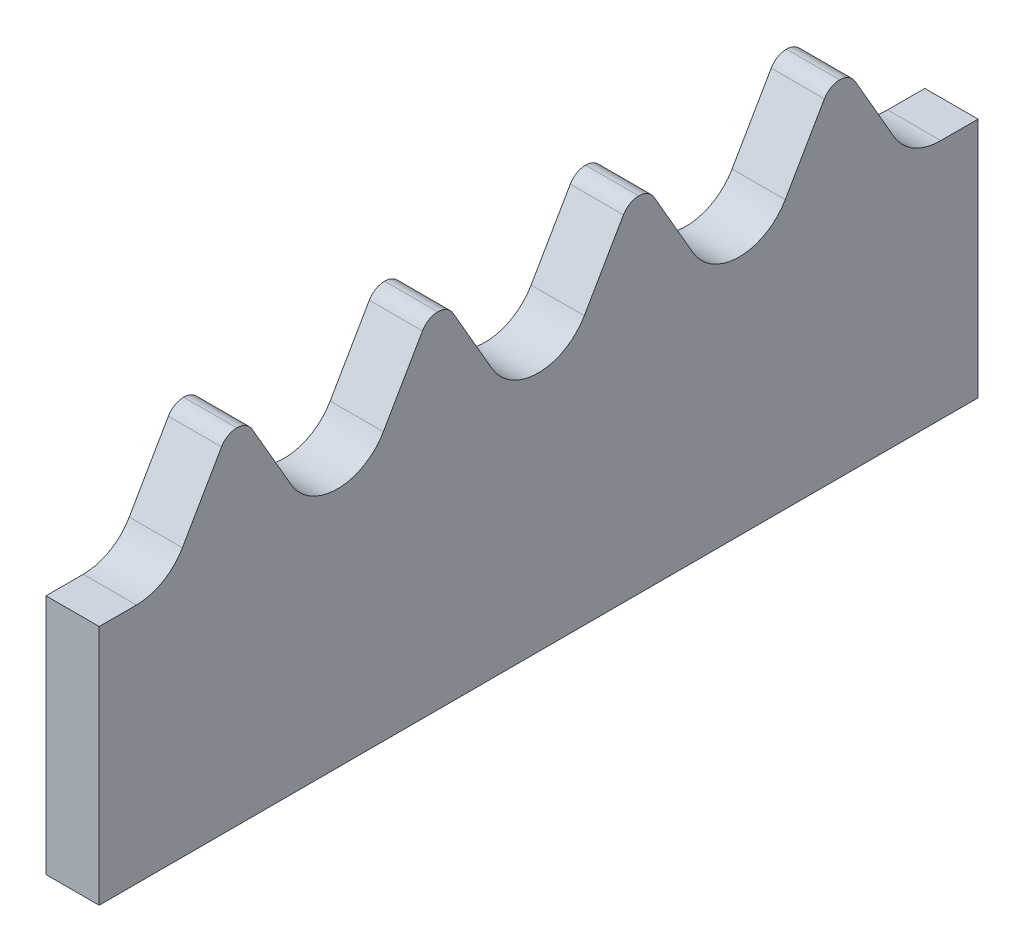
ISO-10303-21;
HEADER;
FILE_DESCRIPTION(('STEP AP214'),'2;1');
FILE_NAME('part.step','',(''),(''),'','','');
FILE_SCHEMA(('AUTOMOTIVE_DESIGN { 1 0 10303 214 1 1 1 1 }'));
ENDSEC;
DATA;
#1=APPLICATION_CONTEXT('core data for automotive mechanical design processes');
#2=APPLICATION_PROTOCOL_DEFINITION('international standard','automotive_design',2000,#1);
#3=PRODUCT_CONTEXT('',#1,'mechanical');
#4=PRODUCT('Part','Part','',(#3));
#5=PRODUCT_RELATED_PRODUCT_CATEGORY('part','',(#4));
#6=PRODUCT_DEFINITION_FORMATION('','',#4);
#7=PRODUCT_DEFINITION_CONTEXT('part definition',#1,'design');
#8=PRODUCT_DEFINITION('design','',#6,#7);
#9=PRODUCT_DEFINITION_SHAPE('','',#8);
#10=(LENGTH_UNIT() NAMED_UNIT(*) SI_UNIT(.MILLI.,.METRE.));
#11=(NAMED_UNIT(*) PLANE_ANGLE_UNIT() SI_UNIT($,.RADIAN.));
#12=(NAMED_UNIT(*) SI_UNIT($,.STERADIAN.) SOLID_ANGLE_UNIT());
#13=UNCERTAINTY_MEASURE_WITH_UNIT(LENGTH_MEASURE(1.E-05),#10,'distance_accuracy_value','');
#14=(GEOMETRIC_REPRESENTATION_CONTEXT(3) GLOBAL_UNCERTAINTY_ASSIGNED_CONTEXT((#13)) GLOBAL_UNIT_ASSIGNED_CONTEXT((#10,
#11,#12)) REPRESENTATION_CONTEXT('',''));
#15=CARTESIAN_POINT('',(0.,0.,0.));
#16=DIRECTION('',(0.,0.,1.));
#17=DIRECTION('',(1.,0.,0.));
#18=AXIS2_PLACEMENT_3D('',#15,#16,#17);
#19=CARTESIAN_POINT('',(-25.9999999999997,30.,44.9999999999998));
#20=DIRECTION('',(-1.,0.,0.));
#21=DIRECTION('',(0.,0.,1.));
#22=AXIS2_PLACEMENT_3D('',#19,#20,#21);
#23=PLANE('',#22);
#24=DIRECTION('',(0.,0.,-1.));
#25=VECTOR('',#24,1.);
#26=CARTESIAN_POINT('',(-25.9999999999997,7.99999999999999,44.9999999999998));
#27=LINE('',#26,#25);
#28=CARTESIAN_POINT('',(-25.9999999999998,8.00000000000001,20.4956734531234));
#29=VERTEX_POINT('',#28);
#30=CARTESIAN_POINT('',(-25.9999999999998,8.00000000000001,-29.1000000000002));
#31=VERTEX_POINT('',#30);
#32=EDGE_CURVE('E277',#29,#31,#27,.T.);
#33=ORIENTED_EDGE('',*,*,#32,.F.);
#34=DIRECTION('',(0.,-1.,0.));
#35=VECTOR('',#34,1.);
#36=CARTESIAN_POINT('',(-25.9999999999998,21.6256246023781,20.4956734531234));
#37=LINE('',#36,#35);
#38=CARTESIAN_POINT('',(-25.9999999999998,21.6256246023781,20.4956734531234));
#39=VERTEX_POINT('',#38);
#40=EDGE_CURVE('E282',#39,#29,#37,.T.);
#41=ORIENTED_EDGE('',*,*,#40,.F.);
#42=DIRECTION('',(0.,0.,1.));
#43=VECTOR('',#42,1.);
#44=CARTESIAN_POINT('',(-25.9999999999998,21.6256246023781,18.3956734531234));
#45=LINE('',#44,#43);
#46=CARTESIAN_POINT('',(-25.9999999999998,21.6256246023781,18.3956734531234));
#47=VERTEX_POINT('',#46);
#48=EDGE_CURVE('E274',#47,#39,#45,.T.);
#49=ORIENTED_EDGE('',*,*,#48,.F.);
#50=CARTESIAN_POINT('',(-25.9999999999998,24.6256246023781,18.3956734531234));
#51=DIRECTION('',(1.,0.,0.));
#52=DIRECTION('',(0.,0.,1.));
#53=AXIS2_PLACEMENT_3D('',#50,#51,#52);
#54=CIRCLE('',#53,3.);
#55=CARTESIAN_POINT('',(-25.9999999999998,23.1256246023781,15.7975972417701));
#56=VERTEX_POINT('',#55);
#57=EDGE_CURVE('E260',#47,#56,#54,.T.);
#58=ORIENTED_EDGE('',*,*,#57,.T.);
#59=DIRECTION('',(0.,0.866025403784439,-0.5));
#60=VECTOR('',#59,1.);
#61=CARTESIAN_POINT('',(-25.9999999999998,26.9487699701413,13.590303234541));
#62=LINE('',#61,#60);
#63=CARTESIAN_POINT('',(-25.9999999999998,26.9487699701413,13.590303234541));
#64=VERTEX_POINT('',#63);
#65=EDGE_CURVE('E267',#56,#64,#62,.T.);
#66=ORIENTED_EDGE('',*,*,#65,.T.);
#67=CARTESIAN_POINT('',(-25.9999999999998,26.4487699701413,12.7242778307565));
#68=DIRECTION('',(-1.,0.,0.));
#69=DIRECTION('',(0.,0.,-1.));
#70=AXIS2_PLACEMENT_3D('',#67,#68,#69);
#71=CIRCLE('',#70,1.);
#72=CARTESIAN_POINT('',(-25.9999999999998,27.4487660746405,12.727069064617));
#73=VERTEX_POINT('',#72);
#74=EDGE_CURVE('E595',#64,#73,#71,.T.);
#75=ORIENTED_EDGE('',*,*,#74,.T.);
#76=CARTESIAN_POINT('',(-25.9999999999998,26.4487699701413,12.7270690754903));
#77=DIRECTION('',(-1.,0.,0.));
#78=DIRECTION('',(0.,0.,-1.));
#79=AXIS2_PLACEMENT_3D('',#76,#77,#78);
#80=CIRCLE('',#79,1.);
#81=CARTESIAN_POINT('',(-25.9999999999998,26.9487699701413,11.8610436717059));
#82=VERTEX_POINT('',#81);
#83=EDGE_CURVE('E592',#73,#82,#80,.T.);
#84=ORIENTED_EDGE('',*,*,#83,.T.);
#85=DIRECTION('',(0.,-0.866025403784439,-0.499999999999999));
#86=VECTOR('',#85,1.);
#87=CARTESIAN_POINT('',(-25.9999999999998,23.1256246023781,9.65374966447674));
#88=LINE('',#87,#86);
#89=CARTESIAN_POINT('',(-25.9999999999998,23.1256246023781,9.65374966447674));
#90=VERTEX_POINT('',#89);
#91=EDGE_CURVE('E589',#82,#90,#88,.T.);
#92=ORIENTED_EDGE('',*,*,#91,.T.);
#93=CARTESIAN_POINT('',(-25.9999999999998,24.6256246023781,7.05567345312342));
#94=DIRECTION('',(1.,0.,0.));
#95=DIRECTION('',(0.,0.,1.));
#96=AXIS2_PLACEMENT_3D('',#93,#94,#95);
#97=CIRCLE('',#96,3.);
#98=CARTESIAN_POINT('',(-25.9999999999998,23.1256246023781,4.45759724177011));
#99=VERTEX_POINT('',#98);
#100=EDGE_CURVE('E586',#90,#99,#97,.T.);
#101=ORIENTED_EDGE('',*,*,#100,.T.);
#102=DIRECTION('',(0.,0.866025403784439,-0.5));
#103=VECTOR('',#102,1.);
#104=CARTESIAN_POINT('',(-25.9999999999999,26.9487699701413,2.25030323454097));
#105=LINE('',#104,#103);
#106=CARTESIAN_POINT('',(-25.9999999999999,26.9487699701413,2.25030323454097));
#107=VERTEX_POINT('',#106);
#108=EDGE_CURVE('E583',#99,#107,#105,.T.);
#109=ORIENTED_EDGE('',*,*,#108,.T.);
#110=CARTESIAN_POINT('',(-25.9999999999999,26.4487699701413,1.38427783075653));
#111=DIRECTION('',(-1.,0.,0.));
#112=DIRECTION('',(0.,0.,-1.));
#113=AXIS2_PLACEMENT_3D('',#110,#111,#112);
#114=CIRCLE('',#113,1.);
#115=CARTESIAN_POINT('',(-25.9999999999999,27.4487660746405,1.38706906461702));
#116=VERTEX_POINT('',#115);
#117=EDGE_CURVE('E580',#107,#116,#114,.T.);
#118=ORIENTED_EDGE('',*,*,#117,.T.);
#119=CARTESIAN_POINT('',(-25.9999999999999,26.4487699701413,1.38706907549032));
#120=DIRECTION('',(-1.,0.,0.));
#121=DIRECTION('',(0.,0.,-1.));
#122=AXIS2_PLACEMENT_3D('',#119,#120,#121);
#123=CIRCLE('',#122,1.);
#124=CARTESIAN_POINT('',(-25.9999999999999,26.9487699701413,0.52104367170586));
#125=VERTEX_POINT('',#124);
#126=EDGE_CURVE('E577',#116,#125,#123,.T.);
#127=ORIENTED_EDGE('',*,*,#126,.T.);
#128=DIRECTION('',(0.,-0.866025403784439,-0.499999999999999));
#129=VECTOR('',#128,1.);
#130=CARTESIAN_POINT('',(-25.9999999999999,23.1256246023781,-1.68625033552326));
#131=LINE('',#130,#129);
#132=CARTESIAN_POINT('',(-25.9999999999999,23.1256246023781,-1.68625033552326));
#133=VERTEX_POINT('',#132);
#134=EDGE_CURVE('E574',#125,#133,#131,.T.);
#135=ORIENTED_EDGE('',*,*,#134,.T.);
#136=CARTESIAN_POINT('',(-25.9999999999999,24.6256246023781,-4.28432654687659));
#137=DIRECTION('',(1.,0.,0.));
#138=DIRECTION('',(0.,0.,1.));
#139=AXIS2_PLACEMENT_3D('',#136,#137,#138);
#140=CIRCLE('',#139,3.);
#141=CARTESIAN_POINT('',(-25.9999999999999,23.1256246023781,-6.8824027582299));
#142=VERTEX_POINT('',#141);
#143=EDGE_CURVE('E571',#133,#142,#140,.T.);
#144=ORIENTED_EDGE('',*,*,#143,.T.);
#145=DIRECTION('',(0.,0.866025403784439,-0.5));
#146=VECTOR('',#145,1.);
#147=CARTESIAN_POINT('',(-25.9999999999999,26.9487699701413,-9.08969676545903));
#148=LINE('',#147,#146);
#149=CARTESIAN_POINT('',(-25.9999999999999,26.9487699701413,-9.08969676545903));
#150=VERTEX_POINT('',#149);
#151=EDGE_CURVE('E568',#142,#150,#148,.T.);
#152=ORIENTED_EDGE('',*,*,#151,.T.);
#153=CARTESIAN_POINT('',(-25.9999999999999,26.4487699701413,-9.95572216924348));
#154=DIRECTION('',(-1.,0.,0.));
#155=DIRECTION('',(0.,0.,-1.));
#156=AXIS2_PLACEMENT_3D('',#153,#154,#155);
#157=CIRCLE('',#156,1.);
#158=CARTESIAN_POINT('',(-25.9999999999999,27.4487660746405,-9.95293093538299));
#159=VERTEX_POINT('',#158);
#160=EDGE_CURVE('E565',#150,#159,#157,.T.);
#161=ORIENTED_EDGE('',*,*,#160,.T.);
#162=CARTESIAN_POINT('',(-25.9999999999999,26.4487699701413,-9.95293092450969));
#163=DIRECTION('',(-1.,0.,0.));
#164=DIRECTION('',(0.,0.,-1.));
#165=AXIS2_PLACEMENT_3D('',#162,#163,#164);
#166=CIRCLE('',#165,1.);
#167=CARTESIAN_POINT('',(-25.9999999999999,26.9487699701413,-10.8189563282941));
#168=VERTEX_POINT('',#167);
#169=EDGE_CURVE('E562',#159,#168,#166,.T.);
#170=ORIENTED_EDGE('',*,*,#169,.T.);
#171=DIRECTION('',(0.,-0.866025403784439,-0.499999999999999));
#172=VECTOR('',#171,1.);
#173=CARTESIAN_POINT('',(-25.9999999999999,23.1256246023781,-13.0262503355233));
#174=LINE('',#173,#172);
#175=CARTESIAN_POINT('',(-25.9999999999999,23.1256246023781,-13.0262503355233));
#176=VERTEX_POINT('',#175);
#177=EDGE_CURVE('E559',#168,#176,#174,.T.);
#178=ORIENTED_EDGE('',*,*,#177,.T.);
#179=CARTESIAN_POINT('',(-25.9999999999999,24.6256246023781,-15.6243265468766));
#180=DIRECTION('',(1.,0.,0.));
#181=DIRECTION('',(0.,0.,1.));
#182=AXIS2_PLACEMENT_3D('',#179,#180,#181);
#183=CIRCLE('',#182,3.);
#184=CARTESIAN_POINT('',(-25.9999999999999,23.1256246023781,-18.2224027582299));
#185=VERTEX_POINT('',#184);
#186=EDGE_CURVE('E556',#176,#185,#183,.T.);
#187=ORIENTED_EDGE('',*,*,#186,.T.);
#188=DIRECTION('',(0.,0.866025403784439,-0.5));
#189=VECTOR('',#188,1.);
#190=CARTESIAN_POINT('',(-25.9999999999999,26.9487699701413,-20.429696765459));
#191=LINE('',#190,#189);
#192=CARTESIAN_POINT('',(-25.9999999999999,26.9487699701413,-20.429696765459));
#193=VERTEX_POINT('',#192);
#194=EDGE_CURVE('E553',#185,#193,#191,.T.);
#195=ORIENTED_EDGE('',*,*,#194,.T.);
#196=CARTESIAN_POINT('',(-25.9999999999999,26.4487699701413,-21.2957221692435));
#197=DIRECTION('',(-1.,0.,0.));
#198=DIRECTION('',(0.,0.,-1.));
#199=AXIS2_PLACEMENT_3D('',#196,#197,#198);
#200=CIRCLE('',#199,1.);
#201=CARTESIAN_POINT('',(-25.9999999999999,27.4487660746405,-21.292930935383));
#202=VERTEX_POINT('',#201);
#203=EDGE_CURVE('E548',#193,#202,#200,.T.);
#204=ORIENTED_EDGE('',*,*,#203,.T.);
#205=CARTESIAN_POINT('',(-25.9999999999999,26.4487699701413,-21.2929309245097));
#206=DIRECTION('',(-1.,0.,0.));
#207=DIRECTION('',(0.,0.,-1.));
#208=AXIS2_PLACEMENT_3D('',#205,#206,#207);
#209=CIRCLE('',#208,1.);
#210=CARTESIAN_POINT('',(-25.9999999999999,26.9487699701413,-22.1589563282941));
#211=VERTEX_POINT('',#210);
#212=EDGE_CURVE('E546',#202,#211,#209,.T.);
#213=ORIENTED_EDGE('',*,*,#212,.T.);
#214=DIRECTION('',(0.,-0.866025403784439,-0.499999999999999));
#215=VECTOR('',#214,1.);
#216=CARTESIAN_POINT('',(-25.9999999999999,23.1256246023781,-24.3662503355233));
#217=LINE('',#216,#215);
#218=CARTESIAN_POINT('',(-25.9999999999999,23.1256246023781,-24.3662503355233));
#219=VERTEX_POINT('',#218);
#220=EDGE_CURVE('E89',#211,#219,#217,.T.);
#221=ORIENTED_EDGE('',*,*,#220,.T.);
#222=CARTESIAN_POINT('',(-25.9999999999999,24.6256246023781,-26.9643265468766));
#223=DIRECTION('',(1.,0.,0.));
#224=DIRECTION('',(0.,0.,1.));
#225=AXIS2_PLACEMENT_3D('',#222,#223,#224);
#226=CIRCLE('',#225,3.);
#227=CARTESIAN_POINT('',(-25.9999999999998,21.6258367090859,-27.0000000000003));
#228=VERTEX_POINT('',#227);
#229=EDGE_CURVE('E13',#219,#228,#226,.T.);
#230=ORIENTED_EDGE('',*,*,#229,.T.);
#231=DIRECTION('',(0.,0.,1.));
#232=VECTOR('',#231,1.);
#233=CARTESIAN_POINT('',(-25.9999999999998,21.6258367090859,-27.0000000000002));
#234=LINE('',#233,#232);
#235=CARTESIAN_POINT('',(-25.9999999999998,21.6258367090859,-29.1000000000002));
#236=VERTEX_POINT('',#235);
#237=EDGE_CURVE('E299',#236,#228,#234,.T.);
#238=ORIENTED_EDGE('',*,*,#237,.F.);
#239=DIRECTION('',(0.,1.,0.));
#240=VECTOR('',#239,1.);
#241=CARTESIAN_POINT('',(-25.9999999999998,21.6258367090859,-29.1000000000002));
#242=LINE('',#241,#240);
#243=EDGE_CURVE('E296',#31,#236,#242,.T.);
#244=ORIENTED_EDGE('',*,*,#243,.F.);
#245=EDGE_LOOP('',(#33,#41,#49,#58,#66,#75,#84,#92,#101,#109,#118,#127,#135,#144,#152,#161,#170,
#178,#187,#195,#204,#213,#221,#230,#238,#244));
#246=FACE_BOUND('',#245,.T.);
#247=ADVANCED_FACE('F80',(#246),#23,.T.);
#248=CARTESIAN_POINT('',(-22.9999999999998,30.,44.9999999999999));
#249=DIRECTION('',(-1.,0.,0.));
#250=DIRECTION('',(0.,0.,1.));
#251=AXIS2_PLACEMENT_3D('',#248,#249,#250);
#252=PLANE('',#251);
#253=CARTESIAN_POINT('',(-22.9999999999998,24.6256246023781,18.3956734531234));
#254=DIRECTION('',(1.,0.,0.));
#255=DIRECTION('',(0.,0.,-1.));
#256=AXIS2_PLACEMENT_3D('',#253,#254,#255);
#257=CIRCLE('',#256,3.);
#258=CARTESIAN_POINT('',(-22.9999999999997,21.6256246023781,18.3956734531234));
#259=VERTEX_POINT('',#258);
#260=CARTESIAN_POINT('',(-22.9999999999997,23.1256246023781,15.7975972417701));
#261=VERTEX_POINT('',#260);
#262=EDGE_CURVE('E98',#259,#261,#257,.T.);
#263=ORIENTED_EDGE('',*,*,#262,.F.);
#264=DIRECTION('',(0.,0.,1.));
#265=VECTOR('',#264,1.);
#266=CARTESIAN_POINT('',(-22.9999999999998,21.6256246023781,18.3956734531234));
#267=LINE('',#266,#265);
#268=CARTESIAN_POINT('',(-22.9999999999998,21.6256246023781,20.4956734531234));
#269=VERTEX_POINT('',#268);
#270=EDGE_CURVE('E276',#259,#269,#267,.T.);
#271=ORIENTED_EDGE('',*,*,#270,.T.);
#272=DIRECTION('',(0.,-1.,0.));
#273=VECTOR('',#272,1.);
#274=CARTESIAN_POINT('',(-22.9999999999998,21.6256246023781,20.4956734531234));
#275=LINE('',#274,#273);
#276=CARTESIAN_POINT('',(-22.9999999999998,8.00000000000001,20.4956734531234));
#277=VERTEX_POINT('',#276);
#278=EDGE_CURVE('E283',#269,#277,#275,.T.);
#279=ORIENTED_EDGE('',*,*,#278,.T.);
#280=DIRECTION('',(0.,0.,1.));
#281=VECTOR('',#280,1.);
#282=CARTESIAN_POINT('',(-22.9999999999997,7.99999999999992,44.9999999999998));
#283=LINE('',#282,#281);
#284=CARTESIAN_POINT('',(-22.9999999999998,8.00000000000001,-29.1000000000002));
#285=VERTEX_POINT('',#284);
#286=EDGE_CURVE('E307',#277,#285,#283,.F.);
#287=ORIENTED_EDGE('',*,*,#286,.T.);
#288=DIRECTION('',(0.,1.,0.));
#289=VECTOR('',#288,1.);
#290=CARTESIAN_POINT('',(-22.9999999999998,21.6258367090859,-29.1000000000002));
#291=LINE('',#290,#289);
#292=CARTESIAN_POINT('',(-22.9999999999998,21.6258367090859,-29.1000000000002));
#293=VERTEX_POINT('',#292);
#294=EDGE_CURVE('E294',#285,#293,#291,.T.);
#295=ORIENTED_EDGE('',*,*,#294,.T.);
#296=DIRECTION('',(0.,0.,1.));
#297=VECTOR('',#296,1.);
#298=CARTESIAN_POINT('',(-22.9999999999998,21.6258367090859,-27.0000000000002));
#299=LINE('',#298,#297);
#300=CARTESIAN_POINT('',(-22.9999999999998,21.6258367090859,-27.0000000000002));
#301=VERTEX_POINT('',#300);
#302=EDGE_CURVE('E300',#293,#301,#299,.T.);
#303=ORIENTED_EDGE('',*,*,#302,.T.);
#304=CARTESIAN_POINT('',(-22.9999999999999,24.6256246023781,-26.9643265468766));
#305=DIRECTION('',(1.,0.,0.));
#306=DIRECTION('',(0.,0.,-1.));
#307=AXIS2_PLACEMENT_3D('',#304,#305,#306);
#308=CIRCLE('',#307,3.);
#309=CARTESIAN_POINT('',(-22.9999999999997,23.1256246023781,-24.3662503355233));
#310=VERTEX_POINT('',#309);
#311=EDGE_CURVE('E232',#310,#301,#308,.T.);
#312=ORIENTED_EDGE('',*,*,#311,.F.);
#313=DIRECTION('',(0.,-0.866025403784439,-0.499999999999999));
#314=VECTOR('',#313,1.);
#315=CARTESIAN_POINT('',(-22.9999999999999,23.1256246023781,-24.3662503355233));
#316=LINE('',#315,#314);
#317=CARTESIAN_POINT('',(-22.9999999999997,26.9487699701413,-22.1589563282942));
#318=VERTEX_POINT('',#317);
#319=EDGE_CURVE('E504',#318,#310,#316,.T.);
#320=ORIENTED_EDGE('',*,*,#319,.F.);
#321=CARTESIAN_POINT('',(-22.9999999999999,26.4487699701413,-21.2929309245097));
#322=DIRECTION('',(-1.,0.,0.));
#323=DIRECTION('',(0.,0.,1.));
#324=AXIS2_PLACEMENT_3D('',#321,#322,#323);
#325=CIRCLE('',#324,1.);
#326=CARTESIAN_POINT('',(-22.9999999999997,27.4487660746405,-21.292930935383));
#327=VERTEX_POINT('',#326);
#328=EDGE_CURVE('E499',#327,#318,#325,.T.);
#329=ORIENTED_EDGE('',*,*,#328,.F.);
#330=CARTESIAN_POINT('',(-22.9999999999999,26.4487699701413,-21.2957221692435));
#331=DIRECTION('',(-1.,0.,0.));
#332=DIRECTION('',(0.,0.,1.));
#333=AXIS2_PLACEMENT_3D('',#330,#331,#332);
#334=CIRCLE('',#333,1.);
#335=CARTESIAN_POINT('',(-22.9999999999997,26.9487699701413,-20.4296967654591));
#336=VERTEX_POINT('',#335);
#337=EDGE_CURVE('E494',#336,#327,#334,.T.);
#338=ORIENTED_EDGE('',*,*,#337,.F.);
#339=DIRECTION('',(0.,0.866025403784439,-0.5));
#340=VECTOR('',#339,1.);
#341=CARTESIAN_POINT('',(-22.9999999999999,26.9487699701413,-20.429696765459));
#342=LINE('',#341,#340);
#343=CARTESIAN_POINT('',(-22.9999999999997,23.1256246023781,-18.2224027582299));
#344=VERTEX_POINT('',#343);
#345=EDGE_CURVE('E489',#344,#336,#342,.T.);
#346=ORIENTED_EDGE('',*,*,#345,.F.);
#347=CARTESIAN_POINT('',(-22.9999999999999,24.6256246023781,-15.6243265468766));
#348=DIRECTION('',(1.,0.,0.));
#349=DIRECTION('',(0.,0.,-1.));
#350=AXIS2_PLACEMENT_3D('',#347,#348,#349);
#351=CIRCLE('',#350,3.);
#352=CARTESIAN_POINT('',(-22.9999999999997,23.1256246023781,-13.0262503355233));
#353=VERTEX_POINT('',#352);
#354=EDGE_CURVE('E484',#353,#344,#351,.T.);
#355=ORIENTED_EDGE('',*,*,#354,.F.);
#356=DIRECTION('',(0.,-0.866025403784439,-0.499999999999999));
#357=VECTOR('',#356,1.);
#358=CARTESIAN_POINT('',(-22.9999999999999,23.1256246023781,-13.0262503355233));
#359=LINE('',#358,#357);
#360=CARTESIAN_POINT('',(-22.9999999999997,26.9487699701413,-10.8189563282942));
#361=VERTEX_POINT('',#360);
#362=EDGE_CURVE('E479',#361,#353,#359,.T.);
#363=ORIENTED_EDGE('',*,*,#362,.F.);
#364=CARTESIAN_POINT('',(-22.9999999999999,26.4487699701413,-9.9529309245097));
#365=DIRECTION('',(-1.,0.,0.));
#366=DIRECTION('',(0.,0.,1.));
#367=AXIS2_PLACEMENT_3D('',#364,#365,#366);
#368=CIRCLE('',#367,1.);
#369=CARTESIAN_POINT('',(-22.9999999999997,27.4487660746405,-9.95293093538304));
#370=VERTEX_POINT('',#369);
#371=EDGE_CURVE('E474',#370,#361,#368,.T.);
#372=ORIENTED_EDGE('',*,*,#371,.F.);
#373=CARTESIAN_POINT('',(-22.9999999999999,26.4487699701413,-9.95572216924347));
#374=DIRECTION('',(-1.,0.,0.));
#375=DIRECTION('',(0.,0.,1.));
#376=AXIS2_PLACEMENT_3D('',#373,#374,#375);
#377=CIRCLE('',#376,1.);
#378=CARTESIAN_POINT('',(-22.9999999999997,26.9487699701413,-9.08969676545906));
#379=VERTEX_POINT('',#378);
#380=EDGE_CURVE('E469',#379,#370,#377,.T.);
#381=ORIENTED_EDGE('',*,*,#380,.F.);
#382=DIRECTION('',(0.,0.866025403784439,-0.5));
#383=VECTOR('',#382,1.);
#384=CARTESIAN_POINT('',(-22.9999999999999,26.9487699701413,-9.08969676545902));
#385=LINE('',#384,#383);
#386=CARTESIAN_POINT('',(-22.9999999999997,23.1256246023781,-6.88240275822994));
#387=VERTEX_POINT('',#386);
#388=EDGE_CURVE('E464',#387,#379,#385,.T.);
#389=ORIENTED_EDGE('',*,*,#388,.F.);
#390=CARTESIAN_POINT('',(-22.9999999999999,24.6256246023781,-4.28432654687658));
#391=DIRECTION('',(1.,0.,0.));
#392=DIRECTION('',(0.,0.,-1.));
#393=AXIS2_PLACEMENT_3D('',#390,#391,#392);
#394=CIRCLE('',#393,3.);
#395=CARTESIAN_POINT('',(-22.9999999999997,23.1256246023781,-1.68625033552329));
#396=VERTEX_POINT('',#395);
#397=EDGE_CURVE('E459',#396,#387,#394,.T.);
#398=ORIENTED_EDGE('',*,*,#397,.F.);
#399=DIRECTION('',(0.,-0.866025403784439,-0.499999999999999));
#400=VECTOR('',#399,1.);
#401=CARTESIAN_POINT('',(-22.9999999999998,23.1256246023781,-1.68625033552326));
#402=LINE('',#401,#400);
#403=CARTESIAN_POINT('',(-22.9999999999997,26.9487699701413,0.521043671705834));
#404=VERTEX_POINT('',#403);
#405=EDGE_CURVE('E454',#404,#396,#402,.T.);
#406=ORIENTED_EDGE('',*,*,#405,.F.);
#407=CARTESIAN_POINT('',(-22.9999999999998,26.4487699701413,1.38706907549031));
#408=DIRECTION('',(-1.,0.,0.));
#409=DIRECTION('',(0.,0.,1.));
#410=AXIS2_PLACEMENT_3D('',#407,#408,#409);
#411=CIRCLE('',#410,1.);
#412=CARTESIAN_POINT('',(-22.9999999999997,27.4487660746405,1.38706906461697));
#413=VERTEX_POINT('',#412);
#414=EDGE_CURVE('E449',#413,#404,#411,.T.);
#415=ORIENTED_EDGE('',*,*,#414,.F.);
#416=CARTESIAN_POINT('',(-22.9999999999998,26.4487699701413,1.38427783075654));
#417=DIRECTION('',(-1.,0.,0.));
#418=DIRECTION('',(0.,0.,1.));
#419=AXIS2_PLACEMENT_3D('',#416,#417,#418);
#420=CIRCLE('',#419,1.);
#421=CARTESIAN_POINT('',(-22.9999999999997,26.9487699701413,2.25030323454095));
#422=VERTEX_POINT('',#421);
#423=EDGE_CURVE('E444',#422,#413,#420,.T.);
#424=ORIENTED_EDGE('',*,*,#423,.F.);
#425=DIRECTION('',(0.,0.866025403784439,-0.5));
#426=VECTOR('',#425,1.);
#427=CARTESIAN_POINT('',(-22.9999999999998,26.9487699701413,2.25030323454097));
#428=LINE('',#427,#426);
#429=CARTESIAN_POINT('',(-22.9999999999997,23.1256246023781,4.45759724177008));
#430=VERTEX_POINT('',#429);
#431=EDGE_CURVE('E439',#430,#422,#428,.T.);
#432=ORIENTED_EDGE('',*,*,#431,.F.);
#433=CARTESIAN_POINT('',(-22.9999999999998,24.6256246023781,7.05567345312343));
#434=DIRECTION('',(1.,0.,0.));
#435=DIRECTION('',(0.,0.,-1.));
#436=AXIS2_PLACEMENT_3D('',#433,#434,#435);
#437=CIRCLE('',#436,3.);
#438=CARTESIAN_POINT('',(-22.9999999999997,23.1256246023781,9.65374966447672));
#439=VERTEX_POINT('',#438);
#440=EDGE_CURVE('E434',#439,#430,#437,.T.);
#441=ORIENTED_EDGE('',*,*,#440,.F.);
#442=DIRECTION('',(0.,-0.866025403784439,-0.499999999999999));
#443=VECTOR('',#442,1.);
#444=CARTESIAN_POINT('',(-22.9999999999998,23.1256246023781,9.65374966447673));
#445=LINE('',#444,#443);
#446=CARTESIAN_POINT('',(-22.9999999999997,26.9487699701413,11.8610436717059));
#447=VERTEX_POINT('',#446);
#448=EDGE_CURVE('E429',#447,#439,#445,.T.);
#449=ORIENTED_EDGE('',*,*,#448,.F.);
#450=CARTESIAN_POINT('',(-22.9999999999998,26.4487699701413,12.7270690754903));
#451=DIRECTION('',(-1.,0.,0.));
#452=DIRECTION('',(0.,0.,1.));
#453=AXIS2_PLACEMENT_3D('',#450,#451,#452);
#454=CIRCLE('',#453,1.);
#455=CARTESIAN_POINT('',(-22.9999999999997,27.4487660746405,12.727069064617));
#456=VERTEX_POINT('',#455);
#457=EDGE_CURVE('E424',#456,#447,#454,.T.);
#458=ORIENTED_EDGE('',*,*,#457,.F.);
#459=CARTESIAN_POINT('',(-22.9999999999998,26.4487699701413,12.7242778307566));
#460=DIRECTION('',(-1.,0.,0.));
#461=DIRECTION('',(0.,0.,1.));
#462=AXIS2_PLACEMENT_3D('',#459,#460,#461);
#463=CIRCLE('',#462,1.);
#464=CARTESIAN_POINT('',(-22.9999999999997,26.9487699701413,13.590303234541));
#465=VERTEX_POINT('',#464);
#466=EDGE_CURVE('E419',#465,#456,#463,.T.);
#467=ORIENTED_EDGE('',*,*,#466,.F.);
#468=DIRECTION('',(0.,0.866025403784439,-0.5));
#469=VECTOR('',#468,1.);
#470=CARTESIAN_POINT('',(-22.9999999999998,26.9487699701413,13.590303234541));
#471=LINE('',#470,#469);
#472=EDGE_CURVE('E413',#261,#465,#471,.T.);
#473=ORIENTED_EDGE('',*,*,#472,.F.);
#474=EDGE_LOOP('',(#263,#271,#279,#287,#295,#303,#312,#320,#329,#338,#346,#355,#363,#372,#381,
#389,#398,#406,#415,#424,#432,#441,#449,#458,#467,#473));
#475=FACE_BOUND('',#474,.T.);
#476=ADVANCED_FACE('F336',(#475),#252,.F.);
#477=CARTESIAN_POINT('',(-25.9999999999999,26.4487699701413,-21.2929309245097));
#478=DIRECTION('',(-1.,0.,0.));
#479=DIRECTION('',(0.,0.,1.));
#480=AXIS2_PLACEMENT_3D('',#477,#478,#479);
#481=CYLINDRICAL_SURFACE('',#480,1.);
#482=DIRECTION('',(-1.,0.,0.));
#483=VECTOR('',#482,1.);
#484=CARTESIAN_POINT('',(-25.9999999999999,26.9487699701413,-22.1589563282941));
#485=LINE('',#484,#483);
#486=EDGE_CURVE('E506',#211,#318,#485,.F.);
#487=ORIENTED_EDGE('',*,*,#486,.F.);
#488=ORIENTED_EDGE('',*,*,#212,.F.);
#489=DIRECTION('',(-1.,0.,0.));
#490=VECTOR('',#489,1.);
#491=CARTESIAN_POINT('',(-25.9999999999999,27.4487660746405,-21.292930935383));
#492=LINE('',#491,#490);
#493=EDGE_CURVE('E501',#202,#327,#492,.F.);
#494=ORIENTED_EDGE('',*,*,#493,.T.);
#495=ORIENTED_EDGE('',*,*,#328,.T.);
#496=EDGE_LOOP('',(#487,#488,#494,#495));
#497=FACE_BOUND('',#496,.T.);
#498=ADVANCED_FACE('F332',(#497),#481,.T.);
#499=CARTESIAN_POINT('',(-25.9999999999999,26.4487699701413,-21.2957221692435));
#500=DIRECTION('',(-1.,0.,0.));
#501=DIRECTION('',(0.,0.,1.));
#502=AXIS2_PLACEMENT_3D('',#499,#500,#501);
#503=CYLINDRICAL_SURFACE('',#502,1.);
#504=ORIENTED_EDGE('',*,*,#493,.F.);
#505=ORIENTED_EDGE('',*,*,#203,.F.);
#506=DIRECTION('',(-1.,0.,0.));
#507=VECTOR('',#506,1.);
#508=CARTESIAN_POINT('',(-25.9999999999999,26.9487699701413,-20.429696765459));
#509=LINE('',#508,#507);
#510=EDGE_CURVE('E496',#193,#336,#509,.F.);
#511=ORIENTED_EDGE('',*,*,#510,.T.);
#512=ORIENTED_EDGE('',*,*,#337,.T.);
#513=EDGE_LOOP('',(#504,#505,#511,#512));
#514=FACE_BOUND('',#513,.T.);
#515=ADVANCED_FACE('F335',(#514),#503,.T.);
#516=CARTESIAN_POINT('',(-25.9999999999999,26.9487699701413,-20.429696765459));
#517=DIRECTION('',(0.,0.5,0.866025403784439));
#518=DIRECTION('',(0.,0.866025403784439,-0.5));
#519=AXIS2_PLACEMENT_3D('',#516,#517,#518);
#520=PLANE('',#519);
#521=ORIENTED_EDGE('',*,*,#510,.F.);
#522=ORIENTED_EDGE('',*,*,#194,.F.);
#523=DIRECTION('',(-1.,0.,0.));
#524=VECTOR('',#523,1.);
#525=CARTESIAN_POINT('',(-25.9999999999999,23.1256246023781,-18.2224027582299));
#526=LINE('',#525,#524);
#527=EDGE_CURVE('E491',#185,#344,#526,.F.);
#528=ORIENTED_EDGE('',*,*,#527,.T.);
#529=ORIENTED_EDGE('',*,*,#345,.T.);
#530=EDGE_LOOP('',(#521,#522,#528,#529));
#531=FACE_BOUND('',#530,.T.);
#532=ADVANCED_FACE('F340',(#531),#520,.T.);
#533=CARTESIAN_POINT('',(-25.9999999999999,24.6256246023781,-15.6243265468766));
#534=DIRECTION('',(1.,0.,0.));
#535=DIRECTION('',(0.,0.,-1.));
#536=AXIS2_PLACEMENT_3D('',#533,#534,#535);
#537=CYLINDRICAL_SURFACE('',#536,3.);
#538=ORIENTED_EDGE('',*,*,#527,.F.);
#539=ORIENTED_EDGE('',*,*,#186,.F.);
#540=DIRECTION('',(-1.,0.,0.));
#541=VECTOR('',#540,1.);
#542=CARTESIAN_POINT('',(-25.9999999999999,23.1256246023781,-13.0262503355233));
#543=LINE('',#542,#541);
#544=EDGE_CURVE('E486',#176,#353,#543,.F.);
#545=ORIENTED_EDGE('',*,*,#544,.T.);
#546=ORIENTED_EDGE('',*,*,#354,.T.);
#547=EDGE_LOOP('',(#538,#539,#545,#546));
#548=FACE_BOUND('',#547,.T.);
#549=ADVANCED_FACE('F344',(#548),#537,.F.);
#550=CARTESIAN_POINT('',(-25.9999999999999,23.1256246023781,-13.0262503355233));
#551=DIRECTION('',(0.,0.499999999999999,-0.86602540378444));
#552=DIRECTION('',(0.,-0.866025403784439,-0.499999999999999));
#553=AXIS2_PLACEMENT_3D('',#550,#551,#552);
#554=PLANE('',#553);
#555=ORIENTED_EDGE('',*,*,#544,.F.);
#556=ORIENTED_EDGE('',*,*,#177,.F.);
#557=DIRECTION('',(-1.,0.,0.));
#558=VECTOR('',#557,1.);
#559=CARTESIAN_POINT('',(-25.9999999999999,26.9487699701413,-10.8189563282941));
#560=LINE('',#559,#558);
#561=EDGE_CURVE('E481',#168,#361,#560,.F.);
#562=ORIENTED_EDGE('',*,*,#561,.T.);
#563=ORIENTED_EDGE('',*,*,#362,.T.);
#564=EDGE_LOOP('',(#555,#556,#562,#563));
#565=FACE_BOUND('',#564,.T.);
#566=ADVANCED_FACE('F348',(#565),#554,.T.);
#567=CARTESIAN_POINT('',(-25.9999999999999,26.4487699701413,-9.95293092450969));
#568=DIRECTION('',(-1.,0.,0.));
#569=DIRECTION('',(0.,0.,1.));
#570=AXIS2_PLACEMENT_3D('',#567,#568,#569);
#571=CYLINDRICAL_SURFACE('',#570,1.);
#572=ORIENTED_EDGE('',*,*,#561,.F.);
#573=ORIENTED_EDGE('',*,*,#169,.F.);
#574=DIRECTION('',(-1.,0.,0.));
#575=VECTOR('',#574,1.);
#576=CARTESIAN_POINT('',(-25.9999999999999,27.4487660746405,-9.95293093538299));
#577=LINE('',#576,#575);
#578=EDGE_CURVE('E476',#159,#370,#577,.F.);
#579=ORIENTED_EDGE('',*,*,#578,.T.);
#580=ORIENTED_EDGE('',*,*,#371,.T.);
#581=EDGE_LOOP('',(#572,#573,#579,#580));
#582=FACE_BOUND('',#581,.T.);
#583=ADVANCED_FACE('F352',(#582),#571,.T.);
#584=CARTESIAN_POINT('',(-25.9999999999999,26.4487699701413,-9.95572216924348));
#585=DIRECTION('',(-1.,0.,0.));
#586=DIRECTION('',(0.,0.,1.));
#587=AXIS2_PLACEMENT_3D('',#584,#585,#586);
#588=CYLINDRICAL_SURFACE('',#587,1.);
#589=ORIENTED_EDGE('',*,*,#578,.F.);
#590=ORIENTED_EDGE('',*,*,#160,.F.);
#591=DIRECTION('',(-1.,0.,0.));
#592=VECTOR('',#591,1.);
#593=CARTESIAN_POINT('',(-25.9999999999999,26.9487699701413,-9.08969676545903));
#594=LINE('',#593,#592);
#595=EDGE_CURVE('E471',#150,#379,#594,.F.);
#596=ORIENTED_EDGE('',*,*,#595,.T.);
#597=ORIENTED_EDGE('',*,*,#380,.T.);
#598=EDGE_LOOP('',(#589,#590,#596,#597));
#599=FACE_BOUND('',#598,.T.);
#600=ADVANCED_FACE('F356',(#599),#588,.T.);
#601=CARTESIAN_POINT('',(-25.9999999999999,26.9487699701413,-9.08969676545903));
#602=DIRECTION('',(0.,0.5,0.866025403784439));
#603=DIRECTION('',(0.,0.866025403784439,-0.5));
#604=AXIS2_PLACEMENT_3D('',#601,#602,#603);
#605=PLANE('',#604);
#606=ORIENTED_EDGE('',*,*,#595,.F.);
#607=ORIENTED_EDGE('',*,*,#151,.F.);
#608=DIRECTION('',(-1.,0.,0.));
#609=VECTOR('',#608,1.);
#610=CARTESIAN_POINT('',(-25.9999999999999,23.1256246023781,-6.8824027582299));
#611=LINE('',#610,#609);
#612=EDGE_CURVE('E466',#142,#387,#611,.F.);
#613=ORIENTED_EDGE('',*,*,#612,.T.);
#614=ORIENTED_EDGE('',*,*,#388,.T.);
#615=EDGE_LOOP('',(#606,#607,#613,#614));
#616=FACE_BOUND('',#615,.T.);
#617=ADVANCED_FACE('F360',(#616),#605,.T.);
#618=CARTESIAN_POINT('',(-25.9999999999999,24.6256246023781,-4.28432654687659));
#619=DIRECTION('',(1.,0.,0.));
#620=DIRECTION('',(0.,0.,-1.));
#621=AXIS2_PLACEMENT_3D('',#618,#619,#620);
#622=CYLINDRICAL_SURFACE('',#621,3.);
#623=ORIENTED_EDGE('',*,*,#612,.F.);
#624=ORIENTED_EDGE('',*,*,#143,.F.);
#625=DIRECTION('',(-1.,0.,0.));
#626=VECTOR('',#625,1.);
#627=CARTESIAN_POINT('',(-25.9999999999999,23.1256246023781,-1.68625033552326));
#628=LINE('',#627,#626);
#629=EDGE_CURVE('E461',#133,#396,#628,.F.);
#630=ORIENTED_EDGE('',*,*,#629,.T.);
#631=ORIENTED_EDGE('',*,*,#397,.T.);
#632=EDGE_LOOP('',(#623,#624,#630,#631));
#633=FACE_BOUND('',#632,.T.);
#634=ADVANCED_FACE('F364',(#633),#622,.F.);
#635=CARTESIAN_POINT('',(-25.9999999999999,23.1256246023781,-1.68625033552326));
#636=DIRECTION('',(0.,0.499999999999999,-0.86602540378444));
#637=DIRECTION('',(0.,-0.866025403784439,-0.499999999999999));
#638=AXIS2_PLACEMENT_3D('',#635,#636,#637);
#639=PLANE('',#638);
#640=ORIENTED_EDGE('',*,*,#629,.F.);
#641=ORIENTED_EDGE('',*,*,#134,.F.);
#642=DIRECTION('',(-1.,0.,0.));
#643=VECTOR('',#642,1.);
#644=CARTESIAN_POINT('',(-25.9999999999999,26.9487699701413,0.52104367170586));
#645=LINE('',#644,#643);
#646=EDGE_CURVE('E456',#125,#404,#645,.F.);
#647=ORIENTED_EDGE('',*,*,#646,.T.);
#648=ORIENTED_EDGE('',*,*,#405,.T.);
#649=EDGE_LOOP('',(#640,#641,#647,#648));
#650=FACE_BOUND('',#649,.T.);
#651=ADVANCED_FACE('F368',(#650),#639,.T.);
#652=CARTESIAN_POINT('',(-25.9999999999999,26.4487699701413,1.38706907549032));
#653=DIRECTION('',(-1.,0.,0.));
#654=DIRECTION('',(0.,0.,1.));
#655=AXIS2_PLACEMENT_3D('',#652,#653,#654);
#656=CYLINDRICAL_SURFACE('',#655,1.);
#657=ORIENTED_EDGE('',*,*,#646,.F.);
#658=ORIENTED_EDGE('',*,*,#126,.F.);
#659=DIRECTION('',(-1.,0.,0.));
#660=VECTOR('',#659,1.);
#661=CARTESIAN_POINT('',(-25.9999999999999,27.4487660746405,1.38706906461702));
#662=LINE('',#661,#660);
#663=EDGE_CURVE('E451',#116,#413,#662,.F.);
#664=ORIENTED_EDGE('',*,*,#663,.T.);
#665=ORIENTED_EDGE('',*,*,#414,.T.);
#666=EDGE_LOOP('',(#657,#658,#664,#665));
#667=FACE_BOUND('',#666,.T.);
#668=ADVANCED_FACE('F372',(#667),#656,.T.);
#669=CARTESIAN_POINT('',(-25.9999999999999,26.4487699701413,1.38427783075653));
#670=DIRECTION('',(-1.,0.,0.));
#671=DIRECTION('',(0.,0.,1.));
#672=AXIS2_PLACEMENT_3D('',#669,#670,#671);
#673=CYLINDRICAL_SURFACE('',#672,1.);
#674=ORIENTED_EDGE('',*,*,#663,.F.);
#675=ORIENTED_EDGE('',*,*,#117,.F.);
#676=DIRECTION('',(-1.,0.,0.));
#677=VECTOR('',#676,1.);
#678=CARTESIAN_POINT('',(-25.9999999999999,26.9487699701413,2.25030323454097));
#679=LINE('',#678,#677);
#680=EDGE_CURVE('E446',#107,#422,#679,.F.);
#681=ORIENTED_EDGE('',*,*,#680,.T.);
#682=ORIENTED_EDGE('',*,*,#423,.T.);
#683=EDGE_LOOP('',(#674,#675,#681,#682));
#684=FACE_BOUND('',#683,.T.);
#685=ADVANCED_FACE('F376',(#684),#673,.T.);
#686=CARTESIAN_POINT('',(-25.9999999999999,26.9487699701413,2.25030323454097));
#687=DIRECTION('',(0.,0.5,0.866025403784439));
#688=DIRECTION('',(0.,0.866025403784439,-0.5));
#689=AXIS2_PLACEMENT_3D('',#686,#687,#688);
#690=PLANE('',#689);
#691=ORIENTED_EDGE('',*,*,#680,.F.);
#692=ORIENTED_EDGE('',*,*,#108,.F.);
#693=DIRECTION('',(-1.,0.,0.));
#694=VECTOR('',#693,1.);
#695=CARTESIAN_POINT('',(-25.9999999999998,23.1256246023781,4.45759724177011));
#696=LINE('',#695,#694);
#697=EDGE_CURVE('E441',#99,#430,#696,.F.);
#698=ORIENTED_EDGE('',*,*,#697,.T.);
#699=ORIENTED_EDGE('',*,*,#431,.T.);
#700=EDGE_LOOP('',(#691,#692,#698,#699));
#701=FACE_BOUND('',#700,.T.);
#702=ADVANCED_FACE('F380',(#701),#690,.T.);
#703=CARTESIAN_POINT('',(-25.9999999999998,24.6256246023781,7.05567345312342));
#704=DIRECTION('',(1.,0.,0.));
#705=DIRECTION('',(0.,0.,-1.));
#706=AXIS2_PLACEMENT_3D('',#703,#704,#705);
#707=CYLINDRICAL_SURFACE('',#706,3.);
#708=ORIENTED_EDGE('',*,*,#697,.F.);
#709=ORIENTED_EDGE('',*,*,#100,.F.);
#710=DIRECTION('',(-1.,0.,0.));
#711=VECTOR('',#710,1.);
#712=CARTESIAN_POINT('',(-25.9999999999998,23.1256246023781,9.65374966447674));
#713=LINE('',#712,#711);
#714=EDGE_CURVE('E436',#90,#439,#713,.F.);
#715=ORIENTED_EDGE('',*,*,#714,.T.);
#716=ORIENTED_EDGE('',*,*,#440,.T.);
#717=EDGE_LOOP('',(#708,#709,#715,#716));
#718=FACE_BOUND('',#717,.T.);
#719=ADVANCED_FACE('F384',(#718),#707,.F.);
#720=CARTESIAN_POINT('',(-25.9999999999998,23.1256246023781,9.65374966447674));
#721=DIRECTION('',(0.,0.499999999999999,-0.86602540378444));
#722=DIRECTION('',(0.,-0.866025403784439,-0.499999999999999));
#723=AXIS2_PLACEMENT_3D('',#720,#721,#722);
#724=PLANE('',#723);
#725=ORIENTED_EDGE('',*,*,#714,.F.);
#726=ORIENTED_EDGE('',*,*,#91,.F.);
#727=DIRECTION('',(-1.,0.,0.));
#728=VECTOR('',#727,1.);
#729=CARTESIAN_POINT('',(-25.9999999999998,26.9487699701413,11.8610436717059));
#730=LINE('',#729,#728);
#731=EDGE_CURVE('E431',#82,#447,#730,.F.);
#732=ORIENTED_EDGE('',*,*,#731,.T.);
#733=ORIENTED_EDGE('',*,*,#448,.T.);
#734=EDGE_LOOP('',(#725,#726,#732,#733));
#735=FACE_BOUND('',#734,.T.);
#736=ADVANCED_FACE('F388',(#735),#724,.T.);
#737=CARTESIAN_POINT('',(-25.9999999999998,26.4487699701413,12.7270690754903));
#738=DIRECTION('',(-1.,0.,0.));
#739=DIRECTION('',(0.,0.,1.));
#740=AXIS2_PLACEMENT_3D('',#737,#738,#739);
#741=CYLINDRICAL_SURFACE('',#740,1.);
#742=ORIENTED_EDGE('',*,*,#731,.F.);
#743=ORIENTED_EDGE('',*,*,#83,.F.);
#744=DIRECTION('',(-1.,0.,0.));
#745=VECTOR('',#744,1.);
#746=CARTESIAN_POINT('',(-25.9999999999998,27.4487660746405,12.727069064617));
#747=LINE('',#746,#745);
#748=EDGE_CURVE('E426',#73,#456,#747,.F.);
#749=ORIENTED_EDGE('',*,*,#748,.T.);
#750=ORIENTED_EDGE('',*,*,#457,.T.);
#751=EDGE_LOOP('',(#742,#743,#749,#750));
#752=FACE_BOUND('',#751,.T.);
#753=ADVANCED_FACE('F392',(#752),#741,.T.);
#754=CARTESIAN_POINT('',(-25.9999999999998,26.4487699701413,12.7242778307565));
#755=DIRECTION('',(-1.,0.,0.));
#756=DIRECTION('',(0.,0.,1.));
#757=AXIS2_PLACEMENT_3D('',#754,#755,#756);
#758=CYLINDRICAL_SURFACE('',#757,1.);
#759=ORIENTED_EDGE('',*,*,#748,.F.);
#760=ORIENTED_EDGE('',*,*,#74,.F.);
#761=DIRECTION('',(-1.,0.,0.));
#762=VECTOR('',#761,1.);
#763=CARTESIAN_POINT('',(-25.9999999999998,26.9487699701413,13.590303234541));
#764=LINE('',#763,#762);
#765=EDGE_CURVE('E421',#64,#465,#764,.F.);
#766=ORIENTED_EDGE('',*,*,#765,.T.);
#767=ORIENTED_EDGE('',*,*,#466,.T.);
#768=EDGE_LOOP('',(#759,#760,#766,#767));
#769=FACE_BOUND('',#768,.T.);
#770=ADVANCED_FACE('F396',(#769),#758,.T.);
#771=CARTESIAN_POINT('',(-25.9999999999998,26.9487699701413,13.590303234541));
#772=DIRECTION('',(0.,0.5,0.866025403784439));
#773=DIRECTION('',(0.,0.866025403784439,-0.5));
#774=AXIS2_PLACEMENT_3D('',#771,#772,#773);
#775=PLANE('',#774);
#776=ORIENTED_EDGE('',*,*,#765,.F.);
#777=ORIENTED_EDGE('',*,*,#65,.F.);
#778=DIRECTION('',(-1.,0.,0.));
#779=VECTOR('',#778,1.);
#780=CARTESIAN_POINT('',(-25.9999999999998,23.1256246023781,15.7975972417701));
#781=LINE('',#780,#779);
#782=EDGE_CURVE('E262',#56,#261,#781,.F.);
#783=ORIENTED_EDGE('',*,*,#782,.T.);
#784=ORIENTED_EDGE('',*,*,#472,.T.);
#785=EDGE_LOOP('',(#776,#777,#783,#784));
#786=FACE_BOUND('',#785,.T.);
#787=ADVANCED_FACE('F400',(#786),#775,.T.);
#788=CARTESIAN_POINT('',(-25.9999999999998,24.6256246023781,18.3956734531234));
#789=DIRECTION('',(1.,0.,0.));
#790=DIRECTION('',(0.,0.,-1.));
#791=AXIS2_PLACEMENT_3D('',#788,#789,#790);
#792=CYLINDRICAL_SURFACE('',#791,3.);
#793=ORIENTED_EDGE('',*,*,#57,.F.);
#794=DIRECTION('',(1.,0.,0.));
#795=VECTOR('',#794,1.);
#796=CARTESIAN_POINT('',(-22.9999999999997,21.6256246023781,18.3956734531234));
#797=LINE('',#796,#795);
#798=EDGE_CURVE('E227',#259,#47,#797,.F.);
#799=ORIENTED_EDGE('',*,*,#798,.F.);
#800=ORIENTED_EDGE('',*,*,#262,.T.);
#801=ORIENTED_EDGE('',*,*,#782,.F.);
#802=EDGE_LOOP('',(#793,#799,#800,#801));
#803=FACE_BOUND('',#802,.T.);
#804=ADVANCED_FACE('F261',(#803),#792,.F.);
#805=CARTESIAN_POINT('',(-25.9999999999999,23.1256246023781,-24.3662503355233));
#806=DIRECTION('',(0.,0.499999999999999,-0.86602540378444));
#807=DIRECTION('',(0.,-0.866025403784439,-0.499999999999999));
#808=AXIS2_PLACEMENT_3D('',#805,#806,#807);
#809=PLANE('',#808);
#810=DIRECTION('',(-1.,0.,0.));
#811=VECTOR('',#810,1.);
#812=CARTESIAN_POINT('',(-25.9999999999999,23.1256246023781,-24.3662503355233));
#813=LINE('',#812,#811);
#814=EDGE_CURVE('E309',#219,#310,#813,.F.);
#815=ORIENTED_EDGE('',*,*,#814,.F.);
#816=ORIENTED_EDGE('',*,*,#220,.F.);
#817=ORIENTED_EDGE('',*,*,#486,.T.);
#818=ORIENTED_EDGE('',*,*,#319,.T.);
#819=EDGE_LOOP('',(#815,#816,#817,#818));
#820=FACE_BOUND('',#819,.T.);
#821=ADVANCED_FACE('F329',(#820),#809,.T.);
#822=CARTESIAN_POINT('',(-25.9999999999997,7.99999999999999,44.9999999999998));
#823=DIRECTION('',(0.,1.,0.));
#824=DIRECTION('',(0.,0.,-1.));
#825=AXIS2_PLACEMENT_3D('',#822,#823,#824);
#826=PLANE('',#825);
#827=ORIENTED_EDGE('',*,*,#32,.T.);
#828=DIRECTION('',(1.,0.,0.));
#829=VECTOR('',#828,1.);
#830=CARTESIAN_POINT('',(-25.9999999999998,8.00000000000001,-29.1000000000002));
#831=LINE('',#830,#829);
#832=EDGE_CURVE('E304',#31,#285,#831,.T.);
#833=ORIENTED_EDGE('',*,*,#832,.T.);
#834=ORIENTED_EDGE('',*,*,#286,.F.);
#835=DIRECTION('',(1.,0.,0.));
#836=VECTOR('',#835,1.);
#837=CARTESIAN_POINT('',(-25.9999999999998,8.00000000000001,20.4956734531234));
#838=LINE('',#837,#836);
#839=EDGE_CURVE('E291',#29,#277,#838,.T.);
#840=ORIENTED_EDGE('',*,*,#839,.F.);
#841=EDGE_LOOP('',(#827,#833,#834,#840));
#842=FACE_BOUND('',#841,.T.);
#843=ADVANCED_FACE('F327',(#842),#826,.F.);
#844=CARTESIAN_POINT('',(-25.9999999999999,24.6256246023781,-26.9643265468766));
#845=DIRECTION('',(1.,0.,0.));
#846=DIRECTION('',(0.,0.,-1.));
#847=AXIS2_PLACEMENT_3D('',#844,#845,#846);
#848=CYLINDRICAL_SURFACE('',#847,3.);
#849=ORIENTED_EDGE('',*,*,#229,.F.);
#850=ORIENTED_EDGE('',*,*,#814,.T.);
#851=ORIENTED_EDGE('',*,*,#311,.T.);
#852=CARTESIAN_POINT('',(-25.9999999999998,21.6258367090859,-27.0000000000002));
#853=DIRECTION('',(1.,0.,0.));
#854=VECTOR('',#853,1.);
#855=LINE('',#852,#854);
#856=EDGE_CURVE('E268',#228,#301,#855,.T.);
#857=ORIENTED_EDGE('',*,*,#856,.F.);
#858=EDGE_LOOP('',(#849,#850,#851,#857));
#859=FACE_BOUND('',#858,.T.);
#860=ADVANCED_FACE('F316',(#859),#848,.F.);
#861=CARTESIAN_POINT('',(-25.9999999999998,21.6258367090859,-27.0000000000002));
#862=DIRECTION('',(0.,1.,0.));
#863=DIRECTION('',(0.,0.,1.));
#864=AXIS2_PLACEMENT_3D('',#861,#862,#863);
#865=PLANE('',#864);
#866=ORIENTED_EDGE('',*,*,#302,.F.);
#867=DIRECTION('',(1.,0.,0.));
#868=VECTOR('',#867,1.);
#869=CARTESIAN_POINT('',(-25.9999999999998,21.6258367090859,-29.1000000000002));
#870=LINE('',#869,#868);
#871=EDGE_CURVE('E278',#236,#293,#870,.T.);
#872=ORIENTED_EDGE('',*,*,#871,.F.);
#873=ORIENTED_EDGE('',*,*,#237,.T.);
#874=ORIENTED_EDGE('',*,*,#856,.T.);
#875=EDGE_LOOP('',(#866,#872,#873,#874));
#876=FACE_BOUND('',#875,.T.);
#877=ADVANCED_FACE('F326',(#876),#865,.T.);
#878=CARTESIAN_POINT('',(-25.9999999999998,21.6258367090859,-29.1000000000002));
#879=DIRECTION('',(0.,0.,-1.));
#880=DIRECTION('',(0.,1.,0.));
#881=AXIS2_PLACEMENT_3D('',#878,#879,#880);
#882=PLANE('',#881);
#883=ORIENTED_EDGE('',*,*,#294,.F.);
#884=ORIENTED_EDGE('',*,*,#832,.F.);
#885=ORIENTED_EDGE('',*,*,#243,.T.);
#886=ORIENTED_EDGE('',*,*,#871,.T.);
#887=EDGE_LOOP('',(#883,#884,#885,#886));
#888=FACE_BOUND('',#887,.T.);
#889=ADVANCED_FACE('F531',(#888),#882,.T.);
#890=CARTESIAN_POINT('',(-25.9999999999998,21.6256246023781,20.4956734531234));
#891=DIRECTION('',(0.,0.,1.));
#892=DIRECTION('',(0.,-1.,0.));
#893=AXIS2_PLACEMENT_3D('',#890,#891,#892);
#894=PLANE('',#893);
#895=ORIENTED_EDGE('',*,*,#278,.F.);
#896=DIRECTION('',(1.,0.,0.));
#897=VECTOR('',#896,1.);
#898=CARTESIAN_POINT('',(-25.9999999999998,21.6256246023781,20.4956734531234));
#899=LINE('',#898,#897);
#900=EDGE_CURVE('E285',#39,#269,#899,.T.);
#901=ORIENTED_EDGE('',*,*,#900,.F.);
#902=ORIENTED_EDGE('',*,*,#40,.T.);
#903=ORIENTED_EDGE('',*,*,#839,.T.);
#904=EDGE_LOOP('',(#895,#901,#902,#903));
#905=FACE_BOUND('',#904,.T.);
#906=ADVANCED_FACE('F534',(#905),#894,.T.);
#907=CARTESIAN_POINT('',(-25.9999999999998,21.6256246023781,18.3956734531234));
#908=DIRECTION('',(0.,1.,0.));
#909=DIRECTION('',(0.,0.,1.));
#910=AXIS2_PLACEMENT_3D('',#907,#908,#909);
#911=PLANE('',#910);
#912=ORIENTED_EDGE('',*,*,#270,.F.);
#913=ORIENTED_EDGE('',*,*,#798,.T.);
#914=ORIENTED_EDGE('',*,*,#48,.T.);
#915=ORIENTED_EDGE('',*,*,#900,.T.);
#916=EDGE_LOOP('',(#912,#913,#914,#915));
#917=FACE_BOUND('',#916,.T.);
#918=ADVANCED_FACE('F273',(#917),#911,.T.);
#919=CLOSED_SHELL('',(#247,#476,#498,#515,#532,#549,#566,#583,#600,#617,#634,#651,#668,#685,
#702,#719,#736,#753,#770,#787,#804,#821,#843,#860,#877,#889,#906,#918));
#920=MANIFOLD_SOLID_BREP('B2',#919);
#921=ADVANCED_BREP_SHAPE_REPRESENTATION('',(#18,#920),#14);
#922=SHAPE_DEFINITION_REPRESENTATION(#9,#921);
ENDSEC;
END-ISO-10303-21;
